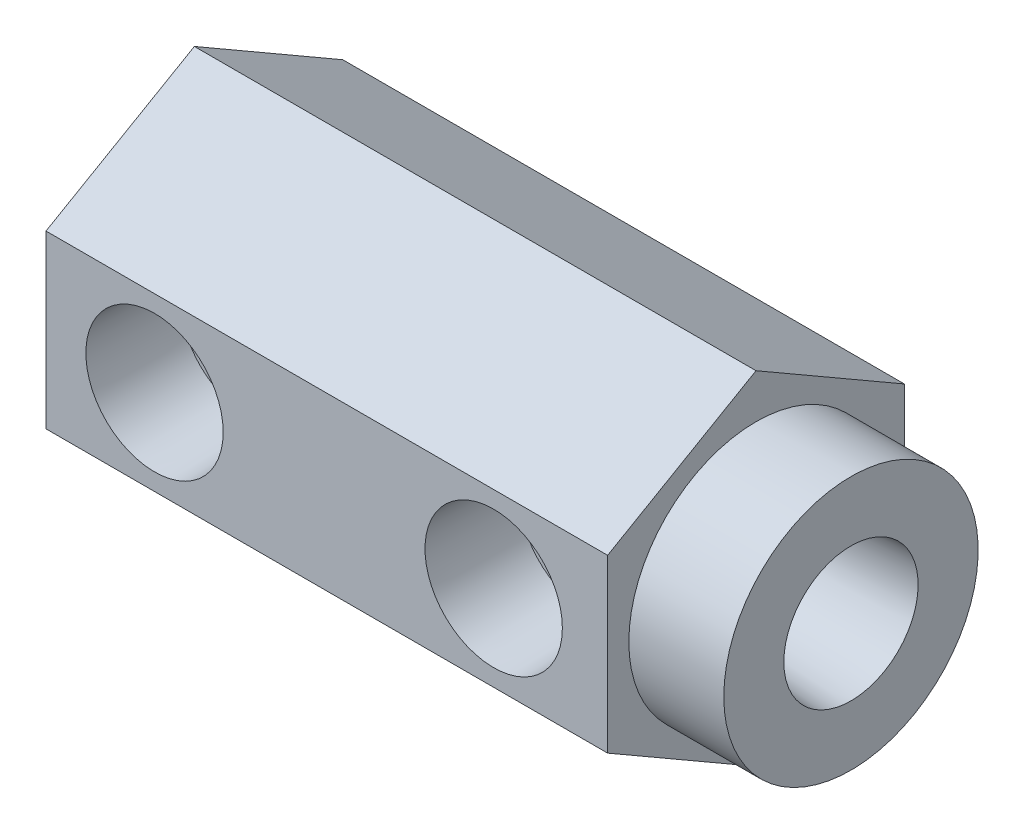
ISO-10303-21;
HEADER;
FILE_DESCRIPTION(('STEP AP214'),'2;1');
FILE_NAME('part.step','',(''),(''),'','','');
FILE_SCHEMA(('AUTOMOTIVE_DESIGN { 1 0 10303 214 1 1 1 1 }'));
ENDSEC;
DATA;
#1=APPLICATION_CONTEXT('core data for automotive mechanical design processes');
#2=APPLICATION_PROTOCOL_DEFINITION('international standard','automotive_design',2000,#1);
#3=PRODUCT_CONTEXT('',#1,'mechanical');
#4=PRODUCT('Part','Part','',(#3));
#5=PRODUCT_RELATED_PRODUCT_CATEGORY('part','',(#4));
#6=PRODUCT_DEFINITION_FORMATION('','',#4);
#7=PRODUCT_DEFINITION_CONTEXT('part definition',#1,'design');
#8=PRODUCT_DEFINITION('design','',#6,#7);
#9=PRODUCT_DEFINITION_SHAPE('','',#8);
#10=(LENGTH_UNIT() NAMED_UNIT(*) SI_UNIT(.MILLI.,.METRE.));
#11=(NAMED_UNIT(*) PLANE_ANGLE_UNIT() SI_UNIT($,.RADIAN.));
#12=(NAMED_UNIT(*) SI_UNIT($,.STERADIAN.) SOLID_ANGLE_UNIT());
#13=UNCERTAINTY_MEASURE_WITH_UNIT(LENGTH_MEASURE(1.E-05),#10,'distance_accuracy_value','');
#14=(GEOMETRIC_REPRESENTATION_CONTEXT(3) GLOBAL_UNCERTAINTY_ASSIGNED_CONTEXT((#13)) GLOBAL_UNIT_ASSIGNED_CONTEXT((#10,
#11,#12)) REPRESENTATION_CONTEXT('',''));
#15=CARTESIAN_POINT('',(0.,0.,0.));
#16=DIRECTION('',(0.,0.,1.));
#17=DIRECTION('',(1.,0.,0.));
#18=AXIS2_PLACEMENT_3D('',#15,#16,#17);
#19=CARTESIAN_POINT('',(49.1744,0.,0.));
#20=DIRECTION('',(-1.,0.,0.));
#21=DIRECTION('',(0.,0.,1.));
#22=AXIS2_PLACEMENT_3D('',#19,#20,#21);
#23=PLANE('',#22);
#24=CARTESIAN_POINT('',(49.1744,0.,0.));
#25=DIRECTION('',(-1.,0.,0.));
#26=DIRECTION('',(0.,0.,1.));
#27=AXIS2_PLACEMENT_3D('',#24,#25,#26);
#28=CIRCLE('',#27,9.525);
#29=CARTESIAN_POINT('',(49.1744,0.,9.525));
#30=VERTEX_POINT('',#29);
#31=EDGE_CURVE('E142',#30,#30,#28,.T.);
#32=ORIENTED_EDGE('',*,*,#31,.F.);
#33=EDGE_LOOP('',(#32));
#34=FACE_BOUND('',#33,.T.);
#35=CARTESIAN_POINT('',(49.1744,0.,0.));
#36=DIRECTION('',(-1.,0.,0.));
#37=DIRECTION('',(0.,0.,1.));
#38=AXIS2_PLACEMENT_3D('',#35,#36,#37);
#39=CIRCLE('',#38,5.0292);
#40=CARTESIAN_POINT('',(49.1744,0.,5.0292));
#41=VERTEX_POINT('',#40);
#42=EDGE_CURVE('E167',#41,#41,#39,.T.);
#43=ORIENTED_EDGE('',*,*,#42,.T.);
#44=EDGE_LOOP('',(#43));
#45=FACE_BOUND('',#44,.T.);
#46=ADVANCED_FACE('F35',(#34,#45),#23,.F.);
#47=CARTESIAN_POINT('',(33.528,0.,11.1125));
#48=DIRECTION('',(0.,0.,1.));
#49=DIRECTION('',(1.,0.,0.));
#50=AXIS2_PLACEMENT_3D('',#47,#48,#49);
#51=CYLINDRICAL_SURFACE('',#50,4.2164);
#52=CARTESIAN_POINT('',(37.5572446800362,1.24226256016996,4.18846));
#53=CARTESIAN_POINT('',(37.5231998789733,1.35273524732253,4.15571145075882));
#54=CARTESIAN_POINT('',(37.4849506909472,1.46061657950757,4.11894514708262));
#55=CARTESIAN_POINT('',(37.4010204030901,1.67046449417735,4.03838194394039));
#56=CARTESIAN_POINT('',(37.3553534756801,1.77244186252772,3.99459845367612));
#57=CARTESIAN_POINT('',(37.2579636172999,1.96909195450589,3.90138657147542));
#58=CARTESIAN_POINT('',(37.2063122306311,2.06383226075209,3.85202501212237));
#59=CARTESIAN_POINT('',(37.0973370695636,2.24704879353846,3.74810382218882));
#60=CARTESIAN_POINT('',(37.040010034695,2.33552136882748,3.69354120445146));
#61=CARTESIAN_POINT('',(36.9057433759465,2.52699524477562,3.56608812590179));
#62=CARTESIAN_POINT('',(36.8274426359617,2.62823562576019,3.49198535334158));
#63=CARTESIAN_POINT('',(36.6643644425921,2.82084714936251,3.33832581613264));
#64=CARTESIAN_POINT('',(36.5795859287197,2.91221667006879,3.25876815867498));
#65=CARTESIAN_POINT('',(36.4040104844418,3.08575940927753,3.09496594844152));
#66=CARTESIAN_POINT('',(36.313183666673,3.16788058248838,3.01069851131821));
#67=CARTESIAN_POINT('',(36.1266289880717,3.32262611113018,2.83900033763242));
#68=CARTESIAN_POINT('',(36.0309017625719,3.39525169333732,2.75157001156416));
#69=CARTESIAN_POINT('',(35.8327510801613,3.53285031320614,2.57262594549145));
#70=CARTESIAN_POINT('',(35.7302251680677,3.59761324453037,2.48106457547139));
#71=CARTESIAN_POINT('',(35.5205770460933,3.7178327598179,2.29700025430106));
#72=CARTESIAN_POINT('',(35.413452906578,3.77328538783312,2.2044969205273));
#73=CARTESIAN_POINT('',(35.1946305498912,3.87490518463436,2.02052791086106));
#74=CARTESIAN_POINT('',(35.0829462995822,3.9210984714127,1.92906002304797));
#75=CARTESIAN_POINT('',(34.8537235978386,4.00442086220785,1.74949909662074));
#76=CARTESIAN_POINT('',(34.7361912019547,4.04155911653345,1.66140272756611));
#77=CARTESIAN_POINT('',(34.5288880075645,4.09683754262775,1.51866750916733));
#78=CARTESIAN_POINT('',(34.4412500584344,4.11734344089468,1.46186744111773));
#79=CARTESIAN_POINT('',(34.2602263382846,4.15335926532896,1.35613372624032));
#80=CARTESIAN_POINT('',(34.166846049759,4.16887387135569,1.30719273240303));
#81=CARTESIAN_POINT('',(34.0032271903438,4.19006857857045,1.23719318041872));
#82=CARTESIAN_POINT('',(33.9349286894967,4.19730703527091,1.21220489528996));
#83=CARTESIAN_POINT('',(33.7951867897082,4.20850549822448,1.17274151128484));
#84=CARTESIAN_POINT('',(33.7237554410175,4.21247707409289,1.15822933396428));
#85=CARTESIAN_POINT('',(33.5783648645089,4.21673052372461,1.14266473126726));
#86=CARTESIAN_POINT('',(33.5043857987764,4.21696850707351,1.14177241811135));
#87=CARTESIAN_POINT('',(33.3576831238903,4.21360126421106,1.15412545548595));
#88=CARTESIAN_POINT('',(33.2849618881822,4.20998943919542,1.16739508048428));
#89=CARTESIAN_POINT('',(33.1190041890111,4.19759986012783,1.21128529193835));
#90=CARTESIAN_POINT('',(33.0270782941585,4.187494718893,1.24623585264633));
#91=CARTESIAN_POINT('',(32.8490963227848,4.16236327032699,1.32777375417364));
#92=CARTESIAN_POINT('',(32.7630740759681,4.14731106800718,1.37442201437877));
#93=CARTESIAN_POINT('',(32.5528728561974,4.10412945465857,1.49961321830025));
#94=CARTESIAN_POINT('',(32.4317509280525,4.07325238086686,1.58224397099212));
#95=CARTESIAN_POINT('',(32.1964925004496,4.00252087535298,1.75355286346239));
#96=CARTESIAN_POINT('',(32.082370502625,3.96264855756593,1.8422428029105));
#97=CARTESIAN_POINT('',(31.8591995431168,3.87396052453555,2.02210861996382));
#98=CARTESIAN_POINT('',(31.7501633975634,3.8251236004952,2.11328994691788));
#99=CARTESIAN_POINT('',(31.5367944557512,3.71851194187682,2.29570274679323));
#100=CARTESIAN_POINT('',(31.4324577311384,3.66074485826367,2.38693411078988));
#101=CARTESIAN_POINT('',(31.2217376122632,3.5320493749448,2.57385350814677));
#102=CARTESIAN_POINT('',(31.1156451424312,3.46051807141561,2.66945656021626));
#103=CARTESIAN_POINT('',(30.9087479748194,3.30668578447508,2.85780367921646));
#104=CARTESIAN_POINT('',(30.8079452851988,3.22438075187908,2.95054665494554));
#105=CARTESIAN_POINT('',(30.6125764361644,3.04885609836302,3.13157084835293));
#106=CARTESIAN_POINT('',(30.5179955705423,2.95566377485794,3.21986246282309));
#107=CARTESIAN_POINT('',(30.3358368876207,2.7579369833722,3.39076686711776));
#108=CARTESIAN_POINT('',(30.248259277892,2.65340217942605,3.47337948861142));
#109=CARTESIAN_POINT('',(30.0468993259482,2.38706899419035,3.66401417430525));
#110=CARTESIAN_POINT('',(29.9372028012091,2.21943248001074,3.76846671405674));
#111=CARTESIAN_POINT('',(29.7890253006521,1.95153796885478,3.91000109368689));
#112=CARTESIAN_POINT('',(29.742405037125,1.85961524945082,3.95461240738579));
#113=CARTESIAN_POINT('',(29.6552306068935,1.67047982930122,4.03813946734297));
#114=CARTESIAN_POINT('',(29.6146718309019,1.57327122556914,4.07705954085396));
#115=CARTESIAN_POINT('',(29.5633807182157,1.43577933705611,4.12632709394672));
#116=CARTESIAN_POINT('',(29.5497360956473,1.3975361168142,4.13943898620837));
#117=CARTESIAN_POINT('',(29.5234701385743,1.32038947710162,4.16468855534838));
#118=CARTESIAN_POINT('',(29.510848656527,1.28148615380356,4.17682637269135));
#119=CARTESIAN_POINT('',(29.4987553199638,1.24226256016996,4.18846));
#120=B_SPLINE_CURVE_WITH_KNOTS('',3,(#52,#53,#54,#55,#56,#57,#58,#59,#60,#61,#62,#63,#64,#65,
#66,#67,#68,#69,#70,#71,#72,#73,#74,#75,#76,#77,#78,#79,#80,#81,#82,#83,#84,#85,#86,#87,#88,#89,
#90,#91,#92,#93,#94,#95,#96,#97,#98,#99,#100,#101,#102,#103,#104,#105,#106,#107,#108,#109,#110,
#111,#112,#113,#114,#115,#116,#117,#118,#119),.UNSPECIFIED.,.F.,.F.,(4,2,2,2,2,2,2,2,2,2,2,2,2,
2,2,2,2,2,2,2,2,2,2,2,2,2,2,2,2,2,2,2,2,4),(0.,0.360139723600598,0.719599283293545,
1.07513522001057,1.43087659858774,1.87389656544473,2.31698921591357,2.76246242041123,
3.2078780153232,3.6633626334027,4.11904029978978,4.57341395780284,5.02732654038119,
5.34631244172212,5.66499838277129,5.88362011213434,6.10146422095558,6.32186731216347,
6.54264879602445,6.83756415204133,7.13404848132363,7.58258817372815,8.03202772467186,
8.48254461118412,8.93267763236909,9.41140117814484,9.89030516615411,10.3680331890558,
10.8457753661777,11.5205176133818,11.8571135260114,12.1934521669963,12.3214366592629,
12.4494026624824),.UNSPECIFIED.);
#121=CARTESIAN_POINT('',(37.5572446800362,1.24226256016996,4.18846));
#122=VERTEX_POINT('',#121);
#123=CARTESIAN_POINT('',(29.4987553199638,1.24226256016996,4.18846));
#124=VERTEX_POINT('',#123);
#125=EDGE_CURVE('E200',#122,#124,#120,.T.);
#126=ORIENTED_EDGE('',*,*,#125,.F.);
#127=CARTESIAN_POINT('',(33.528,0.,4.18846));
#128=DIRECTION('',(0.,0.,1.));
#129=DIRECTION('',(1.,0.,0.));
#130=AXIS2_PLACEMENT_3D('',#127,#128,#129);
#131=CIRCLE('',#130,4.2164);
#132=EDGE_CURVE('E273',#122,#124,#131,.T.);
#133=ORIENTED_EDGE('',*,*,#132,.T.);
#134=EDGE_LOOP('',(#126,#133));
#135=FACE_BOUND('',#134,.T.);
#136=ADVANCED_FACE('F211',(#135),#51,.F.);
#137=CARTESIAN_POINT('',(29.4987553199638,-1.24226256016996,4.18846));
#138=CARTESIAN_POINT('',(29.5328001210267,-1.35273524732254,4.15571145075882));
#139=CARTESIAN_POINT('',(29.5710493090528,-1.46061657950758,4.11894514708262));
#140=CARTESIAN_POINT('',(29.6549795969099,-1.67046449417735,4.03838194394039));
#141=CARTESIAN_POINT('',(29.7006465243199,-1.77244186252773,3.99459845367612));
#142=CARTESIAN_POINT('',(29.7980363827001,-1.96909195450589,3.90138657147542));
#143=CARTESIAN_POINT('',(29.8496877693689,-2.0638322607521,3.85202501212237));
#144=CARTESIAN_POINT('',(29.9586629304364,-2.24704879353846,3.74810382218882));
#145=CARTESIAN_POINT('',(30.015989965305,-2.33552136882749,3.69354120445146));
#146=CARTESIAN_POINT('',(30.1502566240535,-2.52699524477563,3.56608812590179));
#147=CARTESIAN_POINT('',(30.2285573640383,-2.6282356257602,3.49198535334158));
#148=CARTESIAN_POINT('',(30.3916355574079,-2.82084714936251,3.33832581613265));
#149=CARTESIAN_POINT('',(30.4764140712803,-2.9122166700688,3.25876815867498));
#150=CARTESIAN_POINT('',(30.6519895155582,-3.08575940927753,3.09496594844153));
#151=CARTESIAN_POINT('',(30.742816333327,-3.16788058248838,3.01069851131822));
#152=CARTESIAN_POINT('',(30.9293710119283,-3.32262611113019,2.83900033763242));
#153=CARTESIAN_POINT('',(31.0250982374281,-3.39525169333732,2.75157001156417));
#154=CARTESIAN_POINT('',(31.2232489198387,-3.53285031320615,2.57262594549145));
#155=CARTESIAN_POINT('',(31.3257748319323,-3.59761324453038,2.48106457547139));
#156=CARTESIAN_POINT('',(31.5354229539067,-3.7178327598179,2.29700025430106));
#157=CARTESIAN_POINT('',(31.642547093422,-3.77328538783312,2.2044969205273));
#158=CARTESIAN_POINT('',(31.8613694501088,-3.87490518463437,2.02052791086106));
#159=CARTESIAN_POINT('',(31.9730537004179,-3.9210984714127,1.92906002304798));
#160=CARTESIAN_POINT('',(32.2022764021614,-4.00442086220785,1.74949909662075));
#161=CARTESIAN_POINT('',(32.3198087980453,-4.04155911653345,1.66140272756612));
#162=CARTESIAN_POINT('',(32.5271119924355,-4.09683754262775,1.51866750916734));
#163=CARTESIAN_POINT('',(32.6147499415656,-4.11734344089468,1.46186744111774));
#164=CARTESIAN_POINT('',(32.7957736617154,-4.15335926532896,1.35613372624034));
#165=CARTESIAN_POINT('',(32.889153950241,-4.16887387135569,1.30719273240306));
#166=CARTESIAN_POINT('',(33.0527728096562,-4.19006857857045,1.23719318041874));
#167=CARTESIAN_POINT('',(33.1210713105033,-4.19730703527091,1.21220489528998));
#168=CARTESIAN_POINT('',(33.2608132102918,-4.20850549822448,1.17274151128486));
#169=CARTESIAN_POINT('',(33.3322445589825,-4.21247707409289,1.15822933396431));
#170=CARTESIAN_POINT('',(33.4776351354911,-4.21673052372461,1.14266473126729));
#171=CARTESIAN_POINT('',(33.5516142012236,-4.21696850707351,1.14177241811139));
#172=CARTESIAN_POINT('',(33.6983168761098,-4.21360126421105,1.15412545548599));
#173=CARTESIAN_POINT('',(33.7710381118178,-4.20998943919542,1.16739508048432));
#174=CARTESIAN_POINT('',(33.9369958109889,-4.19759986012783,1.21128529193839));
#175=CARTESIAN_POINT('',(34.0289217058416,-4.187494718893,1.24623585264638));
#176=CARTESIAN_POINT('',(34.2069036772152,-4.16236327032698,1.3277737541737));
#177=CARTESIAN_POINT('',(34.292925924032,-4.14731106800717,1.37442201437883));
#178=CARTESIAN_POINT('',(34.5031271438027,-4.10412945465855,1.49961321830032));
#179=CARTESIAN_POINT('',(34.6242490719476,-4.07325238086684,1.5822439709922));
#180=CARTESIAN_POINT('',(34.8595074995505,-4.00252087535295,1.75355286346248));
#181=CARTESIAN_POINT('',(34.9736294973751,-3.9626485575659,1.8422428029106));
#182=CARTESIAN_POINT('',(35.1968004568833,-3.8739605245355,2.02210861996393));
#183=CARTESIAN_POINT('',(35.3058366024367,-3.82512360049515,2.11328994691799));
#184=CARTESIAN_POINT('',(35.5192055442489,-3.71851194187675,2.29570274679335));
#185=CARTESIAN_POINT('',(35.6235422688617,-3.6607448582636,2.38693411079));
#186=CARTESIAN_POINT('',(35.8342623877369,-3.53204937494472,2.5738535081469));
#187=CARTESIAN_POINT('',(35.940354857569,-3.46051807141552,2.66945656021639));
#188=CARTESIAN_POINT('',(36.1472520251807,-3.30668578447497,2.85780367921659));
#189=CARTESIAN_POINT('',(36.2480547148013,-3.22438075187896,2.95054665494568));
#190=CARTESIAN_POINT('',(36.4434235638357,-3.04885609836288,3.13157084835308));
#191=CARTESIAN_POINT('',(36.5380044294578,-2.95566377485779,3.21986246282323));
#192=CARTESIAN_POINT('',(36.7201631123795,-2.75793698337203,3.3907668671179));
#193=CARTESIAN_POINT('',(36.8077407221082,-2.65340217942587,3.47337948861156));
#194=CARTESIAN_POINT('',(37.0091006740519,-2.38706899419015,3.66401417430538));
#195=CARTESIAN_POINT('',(37.118797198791,-2.21943248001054,3.76846671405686));
#196=CARTESIAN_POINT('',(37.2669746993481,-1.95153796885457,3.910001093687));
#197=CARTESIAN_POINT('',(37.3135949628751,-1.85961524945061,3.95461240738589));
#198=CARTESIAN_POINT('',(37.4007693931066,-1.67047982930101,4.03813946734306));
#199=CARTESIAN_POINT('',(37.4413281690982,-1.57327122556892,4.07705954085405));
#200=CARTESIAN_POINT('',(37.4926192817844,-1.43577933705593,4.12632709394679));
#201=CARTESIAN_POINT('',(37.5062639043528,-1.39753611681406,4.13943898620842));
#202=CARTESIAN_POINT('',(37.5325298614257,-1.32038947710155,4.1646885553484));
#203=CARTESIAN_POINT('',(37.545151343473,-1.28148615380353,4.17682637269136));
#204=CARTESIAN_POINT('',(37.5572446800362,-1.24226256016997,4.18846));
#205=B_SPLINE_CURVE_WITH_KNOTS('',3,(#137,#138,#139,#140,#141,#142,#143,#144,#145,#146,#147,
#148,#149,#150,#151,#152,#153,#154,#155,#156,#157,#158,#159,#160,#161,#162,#163,#164,#165,#166,
#167,#168,#169,#170,#171,#172,#173,#174,#175,#176,#177,#178,#179,#180,#181,#182,#183,#184,#185,
#186,#187,#188,#189,#190,#191,#192,#193,#194,#195,#196,#197,#198,#199,#200,#201,#202,#203,#204),
.UNSPECIFIED.,.F.,.F.,(4,2,2,2,2,2,2,2,2,2,2,2,2,2,2,2,2,2,2,2,2,2,2,2,2,2,2,2,2,2,2,2,2,4),(0.,
0.360139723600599,0.719599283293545,1.07513522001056,1.43087659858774,1.87389656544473,
2.31698921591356,2.76246242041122,3.2078780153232,3.6633626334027,4.11904029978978,
4.57341395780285,5.02732654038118,5.34631244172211,5.66499838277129,5.88362011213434,
6.10146422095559,6.32186731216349,6.54264879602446,6.83756415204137,7.13404848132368,
7.58258817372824,8.03202772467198,8.48254461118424,8.93267763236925,9.41140117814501,
9.89030516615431,10.3680331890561,10.8457753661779,11.520517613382,11.8571135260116,
12.1934521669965,12.321436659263,12.4494026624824),.UNSPECIFIED.);
#206=CARTESIAN_POINT('',(29.4987553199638,-1.24226256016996,4.18846));
#207=VERTEX_POINT('',#206);
#208=CARTESIAN_POINT('',(37.5572446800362,-1.24226256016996,4.18846));
#209=VERTEX_POINT('',#208);
#210=EDGE_CURVE('E192',#207,#209,#205,.T.);
#211=ORIENTED_EDGE('',*,*,#210,.F.);
#212=EDGE_CURVE('E276',#207,#209,#131,.T.);
#213=ORIENTED_EDGE('',*,*,#212,.T.);
#214=EDGE_LOOP('',(#211,#213));
#215=FACE_BOUND('',#214,.T.);
#216=ADVANCED_FACE('F215',(#215),#51,.F.);
#217=CARTESIAN_POINT('',(37.7444,0.,4.18846));
#218=DIRECTION('',(0.,0.,-1.));
#219=DIRECTION('',(-1.,0.,0.));
#220=AXIS2_PLACEMENT_3D('',#217,#218,#219);
#221=PLANE('',#220);
#222=DIRECTION('',(-1.,0.,0.));
#223=VECTOR('',#222,1.);
#224=CARTESIAN_POINT('',(0.,-1.24226256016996,4.18846));
#225=LINE('',#224,#223);
#226=CARTESIAN_POINT('',(28.7506884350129,-1.24226256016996,4.18846));
#227=VERTEX_POINT('',#226);
#228=EDGE_CURVE('E363',#227,#207,#225,.F.);
#229=ORIENTED_EDGE('',*,*,#228,.F.);
#230=CARTESIAN_POINT('',(33.528,0.,4.18846));
#231=DIRECTION('',(0.,0.,1.));
#232=DIRECTION('',(1.,0.,0.));
#233=AXIS2_PLACEMENT_3D('',#230,#231,#232);
#234=CIRCLE('',#233,4.93618496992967);
#235=CARTESIAN_POINT('',(38.3053115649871,-1.24226256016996,4.18846));
#236=VERTEX_POINT('',#235);
#237=EDGE_CURVE('E280',#227,#236,#234,.T.);
#238=ORIENTED_EDGE('',*,*,#237,.T.);
#239=EDGE_CURVE('E360',#209,#236,#225,.F.);
#240=ORIENTED_EDGE('',*,*,#239,.F.);
#241=ORIENTED_EDGE('',*,*,#212,.F.);
#242=EDGE_LOOP('',(#229,#238,#240,#241));
#243=FACE_BOUND('',#242,.T.);
#244=ADVANCED_FACE('F218',(#243),#221,.F.);
#245=DIRECTION('',(-1.,0.,0.));
#246=VECTOR('',#245,1.);
#247=CARTESIAN_POINT('',(0.,1.24226256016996,4.18846));
#248=LINE('',#247,#246);
#249=CARTESIAN_POINT('',(38.3053115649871,1.24226256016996,4.18846));
#250=VERTEX_POINT('',#249);
#251=EDGE_CURVE('E205',#250,#122,#248,.T.);
#252=ORIENTED_EDGE('',*,*,#251,.F.);
#253=CARTESIAN_POINT('',(28.7506884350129,1.24226256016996,4.18846));
#254=VERTEX_POINT('',#253);
#255=EDGE_CURVE('E277',#250,#254,#234,.T.);
#256=ORIENTED_EDGE('',*,*,#255,.T.);
#257=EDGE_CURVE('E56',#124,#254,#248,.T.);
#258=ORIENTED_EDGE('',*,*,#257,.F.);
#259=ORIENTED_EDGE('',*,*,#132,.F.);
#260=EDGE_LOOP('',(#252,#256,#258,#259));
#261=FACE_BOUND('',#260,.T.);
#262=ADVANCED_FACE('F344',(#261),#221,.F.);
#263=CARTESIAN_POINT('',(33.528,0.,11.1125));
#264=DIRECTION('',(0.,0.,1.));
#265=DIRECTION('',(1.,0.,0.));
#266=AXIS2_PLACEMENT_3D('',#263,#264,#265);
#267=CONICAL_SURFACE('',#266,5.1435,0.0299323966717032);
#268=CARTESIAN_POINT('',(33.528,0.,11.1125));
#269=DIRECTION('',(0.,0.,1.));
#270=DIRECTION('',(1.,0.,0.));
#271=AXIS2_PLACEMENT_3D('',#268,#269,#270);
#272=CIRCLE('',#271,5.1435);
#273=CARTESIAN_POINT('',(38.6715,0.,11.1125));
#274=VERTEX_POINT('',#273);
#275=EDGE_CURVE('E281',#274,#274,#272,.T.);
#276=ORIENTED_EDGE('',*,*,#275,.T.);
#277=EDGE_LOOP('',(#276));
#278=FACE_BOUND('',#277,.T.);
#279=CARTESIAN_POINT('',(38.3051300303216,-1.24293668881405,4.18826));
#280=CARTESIAN_POINT('',(38.3286071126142,-1.15583523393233,4.21412336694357));
#281=CARTESIAN_POINT('',(38.3497868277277,-1.06732839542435,4.23741836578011));
#282=CARTESIAN_POINT('',(38.3872560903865,-0.888007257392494,4.27858516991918));
#283=CARTESIAN_POINT('',(38.4035434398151,-0.797191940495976,4.29645453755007));
#284=CARTESIAN_POINT('',(38.4309049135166,-0.613876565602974,4.32645329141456));
#285=CARTESIAN_POINT('',(38.4419813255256,-0.521377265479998,4.33858519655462));
#286=CARTESIAN_POINT('',(38.4587218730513,-0.335324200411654,4.35691457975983));
#287=CARTESIAN_POINT('',(38.4643871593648,-0.241770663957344,4.36311331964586));
#288=CARTESIAN_POINT('',(38.4702050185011,-0.0540097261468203,4.36947895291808));
#289=CARTESIAN_POINT('',(38.470341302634,0.0401987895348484,4.36962802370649));
#290=CARTESIAN_POINT('',(38.4650571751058,0.22827319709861,4.36384645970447));
#291=CARTESIAN_POINT('',(38.459636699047,0.322139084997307,4.35791575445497));
#292=CARTESIAN_POINT('',(38.4433617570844,0.508659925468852,4.34009705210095));
#293=CARTESIAN_POINT('',(38.4325165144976,0.601316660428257,4.32821916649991));
#294=CARTESIAN_POINT('',(38.4056075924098,0.784900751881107,4.29871858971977));
#295=CARTESIAN_POINT('',(38.3895464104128,0.875828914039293,4.28109864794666));
#296=CARTESIAN_POINT('',(38.3613463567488,1.01252796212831,4.25011977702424));
#297=CARTESIAN_POINT('',(38.3509951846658,1.05913454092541,4.23874207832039));
#298=CARTESIAN_POINT('',(38.3290123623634,1.15159574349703,4.21456055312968));
#299=CARTESIAN_POINT('',(38.3173825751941,1.19745135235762,4.20175880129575));
#300=CARTESIAN_POINT('',(38.3051300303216,1.24293668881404,4.18826));
#301=B_SPLINE_CURVE_WITH_KNOTS('',3,(#279,#280,#281,#282,#283,#284,#285,#286,#287,#288,#289,
#290,#291,#292,#293,#294,#295,#296,#297,#298,#299,#300),.UNSPECIFIED.,.F.,.F.,(4,2,2,2,2,2,2,2,
2,2,4),(0.,0.281492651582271,0.563111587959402,0.844606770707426,1.12604207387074,
1.40830643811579,1.69057407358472,1.97236341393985,2.25401802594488,2.40121826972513,
2.54820680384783),.UNSPECIFIED.);
#302=EDGE_CURVE('E11',#236,#250,#301,.T.);
#303=ORIENTED_EDGE('',*,*,#302,.F.);
#304=ORIENTED_EDGE('',*,*,#237,.F.);
#305=CARTESIAN_POINT('',(28.7508699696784,1.24293668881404,4.18826));
#306=CARTESIAN_POINT('',(28.7273928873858,1.15583523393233,4.21412336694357));
#307=CARTESIAN_POINT('',(28.7062131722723,1.06732839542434,4.23741836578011));
#308=CARTESIAN_POINT('',(28.6687439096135,0.888007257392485,4.27858516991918));
#309=CARTESIAN_POINT('',(28.6524565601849,0.797191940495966,4.29645453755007));
#310=CARTESIAN_POINT('',(28.6250950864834,0.613876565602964,4.32645329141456));
#311=CARTESIAN_POINT('',(28.6140186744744,0.521377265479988,4.33858519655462));
#312=CARTESIAN_POINT('',(28.5972781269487,0.335324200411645,4.35691457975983));
#313=CARTESIAN_POINT('',(28.5916128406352,0.241770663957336,4.36311331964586));
#314=CARTESIAN_POINT('',(28.5857949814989,0.0540097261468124,4.36947895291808));
#315=CARTESIAN_POINT('',(28.585658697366,-0.0401987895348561,4.36962802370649));
#316=CARTESIAN_POINT('',(28.5909428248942,-0.228273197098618,4.36384645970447));
#317=CARTESIAN_POINT('',(28.596363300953,-0.322139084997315,4.35791575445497));
#318=CARTESIAN_POINT('',(28.6126382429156,-0.50865992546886,4.34009705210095));
#319=CARTESIAN_POINT('',(28.6234834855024,-0.601316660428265,4.32821916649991));
#320=CARTESIAN_POINT('',(28.6503924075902,-0.784900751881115,4.29871858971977));
#321=CARTESIAN_POINT('',(28.6664535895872,-0.875828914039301,4.28109864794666));
#322=CARTESIAN_POINT('',(28.6946536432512,-1.01252796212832,4.25011977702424));
#323=CARTESIAN_POINT('',(28.7050048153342,-1.05913454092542,4.23874207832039));
#324=CARTESIAN_POINT('',(28.7269876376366,-1.15159574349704,4.21456055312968));
#325=CARTESIAN_POINT('',(28.738617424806,-1.19745135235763,4.20175880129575));
#326=CARTESIAN_POINT('',(28.7508699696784,-1.24293668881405,4.18826));
#327=B_SPLINE_CURVE_WITH_KNOTS('',3,(#305,#306,#307,#308,#309,#310,#311,#312,#313,#314,#315,
#316,#317,#318,#319,#320,#321,#322,#323,#324,#325,#326),.UNSPECIFIED.,.F.,.F.,(4,2,2,2,2,2,2,2,
2,2,4),(0.,0.281492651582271,0.563111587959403,0.844606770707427,1.12604207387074,
1.40830643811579,1.69057407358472,1.97236341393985,2.25401802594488,2.40121826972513,
2.54820680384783),.UNSPECIFIED.);
#328=EDGE_CURVE('E49',#254,#227,#327,.T.);
#329=ORIENTED_EDGE('',*,*,#328,.F.);
#330=ORIENTED_EDGE('',*,*,#255,.F.);
#331=EDGE_LOOP('',(#303,#304,#329,#330));
#332=FACE_BOUND('',#331,.T.);
#333=ADVANCED_FACE('F172',(#278,#332),#267,.F.);
#334=CARTESIAN_POINT('',(49.1744,0.,0.));
#335=DIRECTION('',(1.,0.,0.));
#336=DIRECTION('',(0.,0.,-1.));
#337=AXIS2_PLACEMENT_3D('',#334,#335,#336);
#338=CYLINDRICAL_SURFACE('',#337,2.38124999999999);
#339=CARTESIAN_POINT('',(19.2024,0.,0.));
#340=DIRECTION('',(1.,0.,0.));
#341=DIRECTION('',(0.,0.,-1.));
#342=AXIS2_PLACEMENT_3D('',#339,#340,#341);
#343=CIRCLE('',#342,2.38124999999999);
#344=CARTESIAN_POINT('',(19.2024,0.,-2.38124999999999));
#345=VERTEX_POINT('',#344);
#346=EDGE_CURVE('E164',#345,#345,#343,.T.);
#347=ORIENTED_EDGE('',*,*,#346,.F.);
#348=EDGE_LOOP('',(#347));
#349=FACE_BOUND('',#348,.T.);
#350=CARTESIAN_POINT('',(26.9494,0.,0.));
#351=DIRECTION('',(1.,0.,0.));
#352=DIRECTION('',(0.,0.,-1.));
#353=AXIS2_PLACEMENT_3D('',#350,#351,#352);
#354=CIRCLE('',#353,2.38124999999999);
#355=CARTESIAN_POINT('',(26.9494,0.,-2.38124999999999));
#356=VERTEX_POINT('',#355);
#357=EDGE_CURVE('E165',#356,#356,#354,.F.);
#358=ORIENTED_EDGE('',*,*,#357,.F.);
#359=EDGE_LOOP('',(#358));
#360=FACE_BOUND('',#359,.T.);
#361=ADVANCED_FACE('F256',(#349,#360),#338,.F.);
#362=CARTESIAN_POINT('',(42.0624,6.41580486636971,11.1125));
#363=DIRECTION('',(0.,0.,-1.));
#364=DIRECTION('',(0.,1.,0.));
#365=AXIS2_PLACEMENT_3D('',#362,#363,#364);
#366=PLANE('',#365);
#367=CARTESIAN_POINT('',(8.128,0.,11.1125));
#368=DIRECTION('',(0.,0.,1.));
#369=DIRECTION('',(1.,0.,0.));
#370=AXIS2_PLACEMENT_3D('',#367,#368,#369);
#371=CIRCLE('',#370,5.1435);
#372=CARTESIAN_POINT('',(13.2715,0.,11.1125));
#373=VERTEX_POINT('',#372);
#374=EDGE_CURVE('E290',#373,#373,#371,.T.);
#375=ORIENTED_EDGE('',*,*,#374,.F.);
#376=EDGE_LOOP('',(#375));
#377=FACE_BOUND('',#376,.T.);
#378=ORIENTED_EDGE('',*,*,#275,.F.);
#379=EDGE_LOOP('',(#378));
#380=FACE_BOUND('',#379,.T.);
#381=DIRECTION('',(0.,-1.,0.));
#382=VECTOR('',#381,1.);
#383=CARTESIAN_POINT('',(0.,6.41580486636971,11.1125));
#384=LINE('',#383,#382);
#385=CARTESIAN_POINT('',(0.,6.41580486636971,11.1125));
#386=VERTEX_POINT('',#385);
#387=CARTESIAN_POINT('',(0.,-6.41580486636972,11.1125));
#388=VERTEX_POINT('',#387);
#389=EDGE_CURVE('E138',#386,#388,#384,.T.);
#390=ORIENTED_EDGE('',*,*,#389,.T.);
#391=DIRECTION('',(-1.,0.,0.));
#392=VECTOR('',#391,1.);
#393=CARTESIAN_POINT('',(42.0624,-6.41580486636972,11.1125));
#394=LINE('',#393,#392);
#395=CARTESIAN_POINT('',(42.0624,-6.41580486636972,11.1125));
#396=VERTEX_POINT('',#395);
#397=EDGE_CURVE('E157',#396,#388,#394,.T.);
#398=ORIENTED_EDGE('',*,*,#397,.F.);
#399=DIRECTION('',(0.,-1.,0.));
#400=VECTOR('',#399,1.);
#401=CARTESIAN_POINT('',(42.0624,6.41580486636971,11.1125));
#402=LINE('',#401,#400);
#403=CARTESIAN_POINT('',(42.0624,6.41580486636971,11.1125));
#404=VERTEX_POINT('',#403);
#405=EDGE_CURVE('E150',#404,#396,#402,.T.);
#406=ORIENTED_EDGE('',*,*,#405,.F.);
#407=DIRECTION('',(-1.,0.,0.));
#408=VECTOR('',#407,1.);
#409=CARTESIAN_POINT('',(42.0624,6.41580486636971,11.1125));
#410=LINE('',#409,#408);
#411=EDGE_CURVE('E134',#404,#386,#410,.T.);
#412=ORIENTED_EDGE('',*,*,#411,.T.);
#413=EDGE_LOOP('',(#390,#398,#406,#412));
#414=FACE_BOUND('',#413,.T.);
#415=ADVANCED_FACE('F37',(#377,#380,#414),#366,.F.);
#416=CARTESIAN_POINT('',(42.0624,-6.41580486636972,11.1125));
#417=DIRECTION('',(0.,0.866025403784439,-0.5));
#418=DIRECTION('',(0.,0.5,0.866025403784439));
#419=AXIS2_PLACEMENT_3D('',#416,#417,#418);
#420=PLANE('',#419);
#421=DIRECTION('',(0.,-0.5,-0.866025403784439));
#422=VECTOR('',#421,1.);
#423=CARTESIAN_POINT('',(0.,-6.41580486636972,11.1125));
#424=LINE('',#423,#422);
#425=CARTESIAN_POINT('',(0.,-12.8316097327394,0.));
#426=VERTEX_POINT('',#425);
#427=EDGE_CURVE('E141',#388,#426,#424,.T.);
#428=ORIENTED_EDGE('',*,*,#427,.T.);
#429=DIRECTION('',(-1.,0.,0.));
#430=VECTOR('',#429,1.);
#431=CARTESIAN_POINT('',(42.0624,-12.8316097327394,0.));
#432=LINE('',#431,#430);
#433=CARTESIAN_POINT('',(42.0624,-12.8316097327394,0.));
#434=VERTEX_POINT('',#433);
#435=EDGE_CURVE('E154',#434,#426,#432,.T.);
#436=ORIENTED_EDGE('',*,*,#435,.F.);
#437=DIRECTION('',(0.,-0.5,-0.866025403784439));
#438=VECTOR('',#437,1.);
#439=CARTESIAN_POINT('',(42.0624,-6.41580486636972,11.1125));
#440=LINE('',#439,#438);
#441=EDGE_CURVE('E101',#396,#434,#440,.T.);
#442=ORIENTED_EDGE('',*,*,#441,.F.);
#443=ORIENTED_EDGE('',*,*,#397,.T.);
#444=EDGE_LOOP('',(#428,#436,#442,#443));
#445=FACE_BOUND('',#444,.T.);
#446=ADVANCED_FACE('F250',(#445),#420,.F.);
#447=CARTESIAN_POINT('',(42.0624,-12.8316097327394,0.));
#448=DIRECTION('',(0.,0.866025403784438,0.5));
#449=DIRECTION('',(0.,-0.5,0.866025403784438));
#450=AXIS2_PLACEMENT_3D('',#447,#448,#449);
#451=PLANE('',#450);
#452=DIRECTION('',(0.,0.5,-0.866025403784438));
#453=VECTOR('',#452,1.);
#454=CARTESIAN_POINT('',(0.,-12.8316097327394,0.));
#455=LINE('',#454,#453);
#456=CARTESIAN_POINT('',(0.,-6.41580486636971,-11.1125));
#457=VERTEX_POINT('',#456);
#458=EDGE_CURVE('E144',#426,#457,#455,.T.);
#459=ORIENTED_EDGE('',*,*,#458,.T.);
#460=DIRECTION('',(-1.,0.,0.));
#461=VECTOR('',#460,1.);
#462=CARTESIAN_POINT('',(42.0624,-6.41580486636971,-11.1125));
#463=LINE('',#462,#461);
#464=CARTESIAN_POINT('',(42.0624,-6.41580486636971,-11.1125));
#465=VERTEX_POINT('',#464);
#466=EDGE_CURVE('E129',#465,#457,#463,.T.);
#467=ORIENTED_EDGE('',*,*,#466,.F.);
#468=DIRECTION('',(0.,0.5,-0.866025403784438));
#469=VECTOR('',#468,1.);
#470=CARTESIAN_POINT('',(42.0624,-12.8316097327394,0.));
#471=LINE('',#470,#469);
#472=EDGE_CURVE('E117',#434,#465,#471,.T.);
#473=ORIENTED_EDGE('',*,*,#472,.F.);
#474=ORIENTED_EDGE('',*,*,#435,.T.);
#475=EDGE_LOOP('',(#459,#467,#473,#474));
#476=FACE_BOUND('',#475,.T.);
#477=ADVANCED_FACE('F247',(#476),#451,.F.);
#478=CARTESIAN_POINT('',(42.0624,-6.41580486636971,-11.1125));
#479=DIRECTION('',(0.,0.,1.));
#480=DIRECTION('',(1.,0.,0.));
#481=AXIS2_PLACEMENT_3D('',#478,#479,#480);
#482=PLANE('',#481);
#483=CARTESIAN_POINT('',(8.128,0.,-11.1125));
#484=DIRECTION('',(0.,0.,-1.));
#485=DIRECTION('',(-1.,0.,0.));
#486=AXIS2_PLACEMENT_3D('',#483,#484,#485);
#487=CIRCLE('',#486,5.1435);
#488=CARTESIAN_POINT('',(2.9845,0.,-11.1125));
#489=VERTEX_POINT('',#488);
#490=EDGE_CURVE('E299',#489,#489,#487,.T.);
#491=ORIENTED_EDGE('',*,*,#490,.F.);
#492=EDGE_LOOP('',(#491));
#493=FACE_BOUND('',#492,.T.);
#494=DIRECTION('',(0.,1.,0.));
#495=VECTOR('',#494,1.);
#496=CARTESIAN_POINT('',(0.,-6.41580486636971,-11.1125));
#497=LINE('',#496,#495);
#498=CARTESIAN_POINT('',(0.,6.41580486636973,-11.1125));
#499=VERTEX_POINT('',#498);
#500=EDGE_CURVE('E126',#457,#499,#497,.T.);
#501=ORIENTED_EDGE('',*,*,#500,.T.);
#502=DIRECTION('',(-1.,0.,0.));
#503=VECTOR('',#502,1.);
#504=CARTESIAN_POINT('',(42.0624,6.41580486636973,-11.1125));
#505=LINE('',#504,#503);
#506=CARTESIAN_POINT('',(42.0624,6.41580486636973,-11.1125));
#507=VERTEX_POINT('',#506);
#508=EDGE_CURVE('E123',#507,#499,#505,.T.);
#509=ORIENTED_EDGE('',*,*,#508,.F.);
#510=DIRECTION('',(0.,1.,0.));
#511=VECTOR('',#510,1.);
#512=CARTESIAN_POINT('',(42.0624,-6.41580486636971,-11.1125));
#513=LINE('',#512,#511);
#514=EDGE_CURVE('E110',#465,#507,#513,.T.);
#515=ORIENTED_EDGE('',*,*,#514,.F.);
#516=ORIENTED_EDGE('',*,*,#466,.T.);
#517=EDGE_LOOP('',(#501,#509,#515,#516));
#518=FACE_BOUND('',#517,.T.);
#519=ADVANCED_FACE('F124',(#493,#518),#482,.F.);
#520=CARTESIAN_POINT('',(42.0624,6.41580486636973,-11.1125));
#521=DIRECTION('',(0.,-0.866025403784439,0.5));
#522=DIRECTION('',(0.,-0.5,-0.866025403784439));
#523=AXIS2_PLACEMENT_3D('',#520,#521,#522);
#524=PLANE('',#523);
#525=DIRECTION('',(0.,0.5,0.866025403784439));
#526=VECTOR('',#525,1.);
#527=CARTESIAN_POINT('',(0.,6.41580486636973,-11.1125));
#528=LINE('',#527,#526);
#529=CARTESIAN_POINT('',(0.,12.8316097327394,0.));
#530=VERTEX_POINT('',#529);
#531=EDGE_CURVE('E147',#499,#530,#528,.T.);
#532=ORIENTED_EDGE('',*,*,#531,.T.);
#533=DIRECTION('',(-1.,0.,0.));
#534=VECTOR('',#533,1.);
#535=CARTESIAN_POINT('',(42.0624,12.8316097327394,0.));
#536=LINE('',#535,#534);
#537=CARTESIAN_POINT('',(42.0624,12.8316097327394,0.));
#538=VERTEX_POINT('',#537);
#539=EDGE_CURVE('E130',#538,#530,#536,.T.);
#540=ORIENTED_EDGE('',*,*,#539,.F.);
#541=DIRECTION('',(0.,0.5,0.866025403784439));
#542=VECTOR('',#541,1.);
#543=CARTESIAN_POINT('',(42.0624,6.41580486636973,-11.1125));
#544=LINE('',#543,#542);
#545=EDGE_CURVE('E114',#507,#538,#544,.T.);
#546=ORIENTED_EDGE('',*,*,#545,.F.);
#547=ORIENTED_EDGE('',*,*,#508,.T.);
#548=EDGE_LOOP('',(#532,#540,#546,#547));
#549=FACE_BOUND('',#548,.T.);
#550=ADVANCED_FACE('F132',(#549),#524,.F.);
#551=CARTESIAN_POINT('',(42.0624,12.8316097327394,0.));
#552=DIRECTION('',(0.,-0.866025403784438,-0.500000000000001));
#553=DIRECTION('',(0.,0.500000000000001,-0.866025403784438));
#554=AXIS2_PLACEMENT_3D('',#551,#552,#553);
#555=PLANE('',#554);
#556=DIRECTION('',(0.,-0.500000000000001,0.866025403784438));
#557=VECTOR('',#556,1.);
#558=CARTESIAN_POINT('',(0.,12.8316097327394,0.));
#559=LINE('',#558,#557);
#560=EDGE_CURVE('E92',#530,#386,#559,.T.);
#561=ORIENTED_EDGE('',*,*,#560,.T.);
#562=ORIENTED_EDGE('',*,*,#411,.F.);
#563=DIRECTION('',(0.,-0.500000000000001,0.866025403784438));
#564=VECTOR('',#563,1.);
#565=CARTESIAN_POINT('',(42.0624,12.8316097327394,0.));
#566=LINE('',#565,#564);
#567=EDGE_CURVE('E65',#538,#404,#566,.T.);
#568=ORIENTED_EDGE('',*,*,#567,.F.);
#569=ORIENTED_EDGE('',*,*,#539,.T.);
#570=EDGE_LOOP('',(#561,#562,#568,#569));
#571=FACE_BOUND('',#570,.T.);
#572=ADVANCED_FACE('F236',(#571),#555,.F.);
#573=CARTESIAN_POINT('',(42.0624,-6.41580486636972,11.1125));
#574=DIRECTION('',(1.,0.,0.));
#575=DIRECTION('',(0.,0.,-1.));
#576=AXIS2_PLACEMENT_3D('',#573,#574,#575);
#577=PLANE('',#576);
#578=CARTESIAN_POINT('',(42.0624,0.,0.));
#579=DIRECTION('',(1.,0.,0.));
#580=DIRECTION('',(0.,0.,-1.));
#581=AXIS2_PLACEMENT_3D('',#578,#579,#580);
#582=CIRCLE('',#581,9.525);
#583=CARTESIAN_POINT('',(42.0624,0.,-9.525));
#584=VERTEX_POINT('',#583);
#585=EDGE_CURVE('E159',#584,#584,#582,.T.);
#586=ORIENTED_EDGE('',*,*,#585,.F.);
#587=EDGE_LOOP('',(#586));
#588=FACE_BOUND('',#587,.T.);
#589=ORIENTED_EDGE('',*,*,#405,.T.);
#590=ORIENTED_EDGE('',*,*,#441,.T.);
#591=ORIENTED_EDGE('',*,*,#472,.T.);
#592=ORIENTED_EDGE('',*,*,#514,.T.);
#593=ORIENTED_EDGE('',*,*,#545,.T.);
#594=ORIENTED_EDGE('',*,*,#567,.T.);
#595=EDGE_LOOP('',(#589,#590,#591,#592,#593,#594));
#596=FACE_BOUND('',#595,.T.);
#597=ADVANCED_FACE('F112',(#588,#596),#577,.T.);
#598=CARTESIAN_POINT('',(0.,-6.41580486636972,11.1125));
#599=DIRECTION('',(1.,0.,0.));
#600=DIRECTION('',(0.,0.,-1.));
#601=AXIS2_PLACEMENT_3D('',#598,#599,#600);
#602=PLANE('',#601);
#603=ORIENTED_EDGE('',*,*,#389,.F.);
#604=ORIENTED_EDGE('',*,*,#560,.F.);
#605=ORIENTED_EDGE('',*,*,#531,.F.);
#606=ORIENTED_EDGE('',*,*,#500,.F.);
#607=ORIENTED_EDGE('',*,*,#458,.F.);
#608=ORIENTED_EDGE('',*,*,#427,.F.);
#609=EDGE_LOOP('',(#603,#604,#605,#606,#607,#608));
#610=FACE_BOUND('',#609,.T.);
#611=ADVANCED_FACE('F232',(#610),#602,.F.);
#612=CARTESIAN_POINT('',(49.1744,0.,0.));
#613=DIRECTION('',(-1.,0.,0.));
#614=DIRECTION('',(0.,0.,1.));
#615=AXIS2_PLACEMENT_3D('',#612,#613,#614);
#616=CYLINDRICAL_SURFACE('',#615,9.525);
#617=ORIENTED_EDGE('',*,*,#585,.T.);
#618=EDGE_LOOP('',(#617));
#619=FACE_BOUND('',#618,.T.);
#620=ORIENTED_EDGE('',*,*,#31,.T.);
#621=EDGE_LOOP('',(#620));
#622=FACE_BOUND('',#621,.T.);
#623=ADVANCED_FACE('F228',(#619,#622),#616,.T.);
#624=CARTESIAN_POINT('',(8.128,0.,11.1125));
#625=DIRECTION('',(0.,0.,1.));
#626=DIRECTION('',(1.,0.,0.));
#627=AXIS2_PLACEMENT_3D('',#624,#625,#626);
#628=CYLINDRICAL_SURFACE('',#627,4.2164);
#629=CARTESIAN_POINT('',(12.3444,0.,-2.01929999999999));
#630=CARTESIAN_POINT('',(12.3443947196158,0.106687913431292,-2.01929379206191));
#631=CARTESIAN_POINT('',(12.3403065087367,0.213518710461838,-2.01079506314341));
#632=CARTESIAN_POINT('',(12.324356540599,0.424056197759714,-1.97716034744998));
#633=CARTESIAN_POINT('',(12.3124784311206,0.527755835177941,-1.95198936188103));
#634=CARTESIAN_POINT('',(12.2821989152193,0.728658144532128,-1.8862021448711));
#635=CARTESIAN_POINT('',(12.2638221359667,0.825883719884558,-1.84564418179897));
#636=CARTESIAN_POINT('',(12.2222578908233,1.01202231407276,-1.75051924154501));
#637=CARTESIAN_POINT('',(12.1990710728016,1.10093645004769,-1.69595415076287));
#638=CARTESIAN_POINT('',(12.1485066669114,1.27361832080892,-1.57082016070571));
#639=CARTESIAN_POINT('',(12.1209657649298,1.35680605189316,-1.49951775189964));
#640=CARTESIAN_POINT('',(12.0653733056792,1.51056872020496,-1.34450262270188));
#641=CARTESIAN_POINT('',(12.0373214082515,1.58113489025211,-1.26078134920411));
#642=CARTESIAN_POINT('',(11.9816498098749,1.71255866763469,-1.07629586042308));
#643=CARTESIAN_POINT('',(11.9541960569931,1.7723988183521,-0.974751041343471));
#644=CARTESIAN_POINT('',(11.9055283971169,1.87389933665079,-0.761566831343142));
#645=CARTESIAN_POINT('',(11.8843103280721,1.91557183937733,-0.649934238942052));
#646=CARTESIAN_POINT('',(11.8523398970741,1.97698392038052,-0.426331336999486));
#647=CARTESIAN_POINT('',(11.8410563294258,1.99784596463,-0.314748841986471));
#648=CARTESIAN_POINT('',(11.8287790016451,2.02050711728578,-0.0891428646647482));
#649=CARTESIAN_POINT('',(11.8277764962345,2.02232242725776,0.0248784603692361));
#650=CARTESIAN_POINT('',(11.835740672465,2.00766665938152,0.238980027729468));
#651=CARTESIAN_POINT('',(11.843647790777,1.99313940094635,0.339241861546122));
#652=CARTESIAN_POINT('',(11.8667010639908,1.94954991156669,0.535681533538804));
#653=CARTESIAN_POINT('',(11.8818492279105,1.92048364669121,0.631858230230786));
#654=CARTESIAN_POINT('',(11.9180243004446,1.84808217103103,0.820108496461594));
#655=CARTESIAN_POINT('',(11.9391797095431,1.80443089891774,0.912034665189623));
#656=CARTESIAN_POINT('',(11.9849808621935,1.70433373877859,1.08768048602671));
#657=CARTESIAN_POINT('',(12.0096281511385,1.64788217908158,1.17139647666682));
#658=CARTESIAN_POINT('',(12.0630694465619,1.51619938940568,1.33838656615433));
#659=CARTESIAN_POINT('',(12.0920142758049,1.43955472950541,1.42050154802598));
#660=CARTESIAN_POINT('',(12.1484663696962,1.27341129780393,1.57117111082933));
#661=CARTESIAN_POINT('',(12.1759730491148,1.1839073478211,1.63972020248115));
#662=CARTESIAN_POINT('',(12.2277795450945,0.990088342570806,1.76381495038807));
#663=CARTESIAN_POINT('',(12.2519106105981,0.885329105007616,1.81874288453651));
#664=CARTESIAN_POINT('',(12.2928537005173,0.666605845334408,1.90976726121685));
#665=CARTESIAN_POINT('',(12.3096710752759,0.552648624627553,1.94587747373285));
#666=CARTESIAN_POINT('',(12.3329916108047,0.328309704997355,1.99547875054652));
#667=CARTESIAN_POINT('',(12.3401974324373,0.21834329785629,2.01051544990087));
#668=CARTESIAN_POINT('',(12.3458467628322,-0.00277260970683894,2.02232712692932));
#669=CARTESIAN_POINT('',(12.3442939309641,-0.113921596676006,2.01910973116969));
#670=CARTESIAN_POINT('',(12.3330254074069,-0.326023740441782,1.99546315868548));
#671=CARTESIAN_POINT('',(12.3238866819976,-0.427147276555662,1.97625026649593));
#672=CARTESIAN_POINT('',(12.2990742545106,-0.624556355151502,1.92300728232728));
#673=CARTESIAN_POINT('',(12.2833998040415,-0.720841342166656,1.88897549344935));
#674=CARTESIAN_POINT('',(12.2463664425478,-0.909163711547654,1.80607296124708));
#675=CARTESIAN_POINT('',(12.2248507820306,-1.00098632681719,1.75678680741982));
#676=CARTESIAN_POINT('',(12.1782688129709,-1.17537718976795,1.64523197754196));
#677=CARTESIAN_POINT('',(12.1532009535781,-1.25794136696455,1.58295762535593));
#678=CARTESIAN_POINT('',(12.0992710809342,-1.41948396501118,1.44057879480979));
#679=CARTESIAN_POINT('',(12.0702719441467,-1.49743912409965,1.35936289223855));
#680=CARTESIAN_POINT('',(12.013541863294,-1.63903132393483,1.18481538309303));
#681=CARTESIAN_POINT('',(11.9858116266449,-1.70266045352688,1.09147712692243));
#682=CARTESIAN_POINT('',(11.9338112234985,-1.81600503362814,0.890769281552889));
#683=CARTESIAN_POINT('',(11.9097123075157,-1.86510080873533,0.783001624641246));
#684=CARTESIAN_POINT('',(11.8698056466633,-1.94394019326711,0.559196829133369));
#685=CARTESIAN_POINT('',(11.8539881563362,-1.9737065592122,0.443169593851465));
#686=CARTESIAN_POINT('',(11.8342677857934,-2.01047355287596,0.217679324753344));
#687=CARTESIAN_POINT('',(11.8293967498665,-2.01932799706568,0.108604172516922));
#688=CARTESIAN_POINT('',(11.8294288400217,-2.01927189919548,-0.10952351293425));
#689=CARTESIAN_POINT('',(11.8343287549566,-2.01036719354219,-0.218576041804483));
#690=CARTESIAN_POINT('',(11.8523574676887,-1.97674011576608,-0.424338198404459));
#691=CARTESIAN_POINT('',(11.8647906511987,-1.95335151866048,-0.52133390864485));
#692=CARTESIAN_POINT('',(11.8957350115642,-1.89297275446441,-0.709957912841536));
#693=CARTESIAN_POINT('',(11.9142480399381,-1.85597844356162,-0.801584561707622));
#694=CARTESIAN_POINT('',(11.9567879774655,-1.76663819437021,-0.983627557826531));
#695=CARTESIAN_POINT('',(11.9811010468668,-1.71343032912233,-1.07355223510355));
#696=CARTESIAN_POINT('',(12.0319461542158,-1.59418732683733,-1.2437641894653));
#697=CARTESIAN_POINT('',(12.0584792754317,-1.52814590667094,-1.32404671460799));
#698=CARTESIAN_POINT('',(12.1142040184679,-1.37673061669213,-1.48168072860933));
#699=CARTESIAN_POINT('',(12.1433736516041,-1.29003977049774,-1.55778172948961));
#700=CARTESIAN_POINT('',(12.1983964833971,-1.10421108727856,-1.69457937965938));
#701=CARTESIAN_POINT('',(12.2242480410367,-1.00506713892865,-1.75526842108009));
#702=CARTESIAN_POINT('',(12.2697969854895,-0.796801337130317,-1.85908628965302));
#703=CARTESIAN_POINT('',(12.2895022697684,-0.68769252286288,-1.90223767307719));
#704=CARTESIAN_POINT('',(12.3204605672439,-0.462707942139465,-1.96905011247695));
#705=CARTESIAN_POINT('',(12.3317383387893,-0.346853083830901,-1.99276827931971));
#706=CARTESIAN_POINT('',(12.3402176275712,-0.191644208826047,-2.0105538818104));
#707=CARTESIAN_POINT('',(12.3417825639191,-0.15341184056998,-2.01382975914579));
#708=CARTESIAN_POINT('',(12.343874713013,-0.0767924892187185,-2.01820396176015));
#709=CARTESIAN_POINT('',(12.3444019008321,-0.038405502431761,-2.0193022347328));
#710=CARTESIAN_POINT('',(12.3444,0.,-2.01929999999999));
#711=B_SPLINE_CURVE_WITH_KNOTS('',3,(#629,#630,#631,#632,#633,#634,#635,#636,#637,#638,#639,
#640,#641,#642,#643,#644,#645,#646,#647,#648,#649,#650,#651,#652,#653,#654,#655,#656,#657,#658,
#659,#660,#661,#662,#663,#664,#665,#666,#667,#668,#669,#670,#671,#672,#673,#674,#675,#676,#677,
#678,#679,#680,#681,#682,#683,#684,#685,#686,#687,#688,#689,#690,#691,#692,#693,#694,#695,#696,
#697,#698,#699,#700,#701,#702,#703,#704,#705,#706,#707,#708,#709,#710),.UNSPECIFIED.,.T.,.F.,(4,
2,2,2,2,2,2,2,2,2,2,2,2,2,2,2,2,2,2,2,2,2,2,2,2,2,2,2,2,2,2,2,2,2,2,2,2,2,2,2,4),(0.,
0.319907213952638,0.640488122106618,0.959866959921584,1.27920280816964,1.61669430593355,
1.95441932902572,2.31564840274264,2.67663582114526,3.01688536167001,3.35684545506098,
3.66027862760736,3.96379603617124,4.27437070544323,4.58508325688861,4.93154597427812,
5.27814859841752,5.63838803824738,5.99836349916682,6.33023891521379,6.66197568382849,
6.97057174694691,7.27920315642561,7.59711450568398,7.91516508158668,8.26238386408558,
8.6097939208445,8.97038842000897,9.33055761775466,9.65735534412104,9.98404568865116,
10.284385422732,10.5848167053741,10.905360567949,11.2260617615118,11.5813594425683,
11.9368321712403,12.2918462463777,12.6458132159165,12.7609706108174,12.8761307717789),.UNSPECIFIED.);
#712=CARTESIAN_POINT('',(12.3444,0.,-2.01929999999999));
#713=VERTEX_POINT('',#712);
#714=EDGE_CURVE('E163',#713,#713,#711,.T.);
#715=ORIENTED_EDGE('',*,*,#714,.T.);
#716=EDGE_LOOP('',(#715));
#717=FACE_BOUND('',#716,.T.);
#718=CARTESIAN_POINT('',(8.128,0.,-4.18846));
#719=DIRECTION('',(0.,0.,-1.));
#720=DIRECTION('',(-1.,0.,0.));
#721=AXIS2_PLACEMENT_3D('',#718,#719,#720);
#722=CIRCLE('',#721,4.21640000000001);
#723=CARTESIAN_POINT('',(3.91159999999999,0.,-4.18846));
#724=VERTEX_POINT('',#723);
#725=EDGE_CURVE('E293',#724,#724,#722,.T.);
#726=ORIENTED_EDGE('',*,*,#725,.T.);
#727=EDGE_LOOP('',(#726));
#728=FACE_BOUND('',#727,.T.);
#729=CARTESIAN_POINT('',(8.128,0.,4.18846));
#730=DIRECTION('',(0.,0.,1.));
#731=DIRECTION('',(1.,0.,0.));
#732=AXIS2_PLACEMENT_3D('',#729,#730,#731);
#733=CIRCLE('',#732,4.2164);
#734=CARTESIAN_POINT('',(12.3444,0.,4.18846));
#735=VERTEX_POINT('',#734);
#736=EDGE_CURVE('E284',#735,#735,#733,.T.);
#737=ORIENTED_EDGE('',*,*,#736,.T.);
#738=EDGE_LOOP('',(#737));
#739=FACE_BOUND('',#738,.T.);
#740=ADVANCED_FACE('F231',(#717,#728,#739),#628,.F.);
#741=CARTESIAN_POINT('',(12.3444,0.,4.18846));
#742=DIRECTION('',(0.,0.,-1.));
#743=DIRECTION('',(-1.,0.,0.));
#744=AXIS2_PLACEMENT_3D('',#741,#742,#743);
#745=PLANE('',#744);
#746=ORIENTED_EDGE('',*,*,#736,.F.);
#747=EDGE_LOOP('',(#746));
#748=FACE_BOUND('',#747,.T.);
#749=CARTESIAN_POINT('',(8.128,0.,4.18846));
#750=DIRECTION('',(0.,0.,1.));
#751=DIRECTION('',(1.,0.,0.));
#752=AXIS2_PLACEMENT_3D('',#749,#750,#751);
#753=CIRCLE('',#752,4.93618496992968);
#754=CARTESIAN_POINT('',(13.0641849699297,0.,4.18846));
#755=VERTEX_POINT('',#754);
#756=EDGE_CURVE('E287',#755,#755,#753,.T.);
#757=ORIENTED_EDGE('',*,*,#756,.T.);
#758=EDGE_LOOP('',(#757));
#759=FACE_BOUND('',#758,.T.);
#760=ADVANCED_FACE('F326',(#748,#759),#745,.F.);
#761=CARTESIAN_POINT('',(8.128,0.,11.1125));
#762=DIRECTION('',(0.,0.,1.));
#763=DIRECTION('',(1.,0.,0.));
#764=AXIS2_PLACEMENT_3D('',#761,#762,#763);
#765=CONICAL_SURFACE('',#764,5.1435,0.0299323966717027);
#766=ORIENTED_EDGE('',*,*,#756,.F.);
#767=EDGE_LOOP('',(#766));
#768=FACE_BOUND('',#767,.T.);
#769=ORIENTED_EDGE('',*,*,#374,.T.);
#770=EDGE_LOOP('',(#769));
#771=FACE_BOUND('',#770,.T.);
#772=ADVANCED_FACE('F323',(#768,#771),#765,.F.);
#773=CARTESIAN_POINT('',(12.3444,0.,-4.18846));
#774=DIRECTION('',(0.,0.,1.));
#775=DIRECTION('',(1.,0.,0.));
#776=AXIS2_PLACEMENT_3D('',#773,#774,#775);
#777=PLANE('',#776);
#778=ORIENTED_EDGE('',*,*,#725,.F.);
#779=EDGE_LOOP('',(#778));
#780=FACE_BOUND('',#779,.T.);
#781=CARTESIAN_POINT('',(8.128,0.,-4.18846));
#782=DIRECTION('',(0.,0.,-1.));
#783=DIRECTION('',(-1.,0.,0.));
#784=AXIS2_PLACEMENT_3D('',#781,#782,#783);
#785=CIRCLE('',#784,4.93618496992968);
#786=CARTESIAN_POINT('',(3.19181503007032,0.,-4.18846));
#787=VERTEX_POINT('',#786);
#788=EDGE_CURVE('E296',#787,#787,#785,.T.);
#789=ORIENTED_EDGE('',*,*,#788,.T.);
#790=EDGE_LOOP('',(#789));
#791=FACE_BOUND('',#790,.T.);
#792=ADVANCED_FACE('F319',(#780,#791),#777,.F.);
#793=CARTESIAN_POINT('',(8.128,0.,-11.1125));
#794=DIRECTION('',(0.,0.,-1.));
#795=DIRECTION('',(-1.,0.,0.));
#796=AXIS2_PLACEMENT_3D('',#793,#794,#795);
#797=CONICAL_SURFACE('',#796,5.1435,0.0299323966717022);
#798=ORIENTED_EDGE('',*,*,#788,.F.);
#799=EDGE_LOOP('',(#798));
#800=FACE_BOUND('',#799,.T.);
#801=ORIENTED_EDGE('',*,*,#490,.T.);
#802=EDGE_LOOP('',(#801));
#803=FACE_BOUND('',#802,.T.);
#804=ADVANCED_FACE('F314',(#800,#803),#797,.F.);
#805=CARTESIAN_POINT('',(49.1744,0.,0.));
#806=DIRECTION('',(1.,0.,0.));
#807=DIRECTION('',(0.,0.,-1.));
#808=AXIS2_PLACEMENT_3D('',#805,#806,#807);
#809=CYLINDRICAL_SURFACE('',#808,2.01929999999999);
#810=CARTESIAN_POINT('',(18.984918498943,0.,0.));
#811=DIRECTION('',(1.,0.,0.));
#812=DIRECTION('',(0.,0.,-1.));
#813=AXIS2_PLACEMENT_3D('',#810,#811,#812);
#814=CIRCLE('',#813,2.01929999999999);
#815=CARTESIAN_POINT('',(18.984918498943,0.,-2.01929999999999));
#816=VERTEX_POINT('',#815);
#817=EDGE_CURVE('E160',#816,#816,#814,.T.);
#818=ORIENTED_EDGE('',*,*,#817,.T.);
#819=EDGE_LOOP('',(#818));
#820=FACE_BOUND('',#819,.T.);
#821=ORIENTED_EDGE('',*,*,#714,.F.);
#822=EDGE_LOOP('',(#821));
#823=FACE_BOUND('',#822,.T.);
#824=ADVANCED_FACE('F309',(#820,#823),#809,.F.);
#825=CARTESIAN_POINT('',(19.2024,0.,0.));
#826=DIRECTION('',(1.,0.,0.));
#827=DIRECTION('',(0.,0.,-1.));
#828=AXIS2_PLACEMENT_3D('',#825,#826,#827);
#829=CONICAL_SURFACE('',#828,2.38124999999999,1.02974425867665);
#830=ORIENTED_EDGE('',*,*,#346,.T.);
#831=EDGE_LOOP('',(#830));
#832=FACE_BOUND('',#831,.T.);
#833=ORIENTED_EDGE('',*,*,#817,.F.);
#834=EDGE_LOOP('',(#833));
#835=FACE_BOUND('',#834,.T.);
#836=ADVANCED_FACE('F182',(#832,#835),#829,.F.);
#837=CARTESIAN_POINT('',(0.,0.,0.));
#838=DIRECTION('',(-1.,0.,0.));
#839=DIRECTION('',(0.,0.,1.));
#840=AXIS2_PLACEMENT_3D('',#837,#838,#839);
#841=CYLINDRICAL_SURFACE('',#840,4.3688);
#842=CARTESIAN_POINT('',(42.2402,0.,0.));
#843=DIRECTION('',(-1.,0.,0.));
#844=DIRECTION('',(0.,0.,1.));
#845=AXIS2_PLACEMENT_3D('',#842,#843,#844);
#846=CIRCLE('',#845,4.3688);
#847=CARTESIAN_POINT('',(42.2402,0.,4.3688));
#848=VERTEX_POINT('',#847);
#849=EDGE_CURVE('E379',#848,#848,#846,.T.);
#850=ORIENTED_EDGE('',*,*,#849,.F.);
#851=EDGE_LOOP('',(#850));
#852=FACE_BOUND('',#851,.T.);
#853=CARTESIAN_POINT('',(26.9494,0.,0.));
#854=DIRECTION('',(-1.,0.,0.));
#855=DIRECTION('',(0.,0.,1.));
#856=AXIS2_PLACEMENT_3D('',#853,#854,#855);
#857=CIRCLE('',#856,4.3688);
#858=CARTESIAN_POINT('',(26.9494,0.,4.3688));
#859=VERTEX_POINT('',#858);
#860=EDGE_CURVE('E376',#859,#859,#857,.T.);
#861=ORIENTED_EDGE('',*,*,#860,.T.);
#862=EDGE_LOOP('',(#861));
#863=FACE_BOUND('',#862,.T.);
#864=ORIENTED_EDGE('',*,*,#302,.T.);
#865=ORIENTED_EDGE('',*,*,#251,.T.);
#866=ORIENTED_EDGE('',*,*,#125,.T.);
#867=ORIENTED_EDGE('',*,*,#257,.T.);
#868=ORIENTED_EDGE('',*,*,#328,.T.);
#869=ORIENTED_EDGE('',*,*,#228,.T.);
#870=ORIENTED_EDGE('',*,*,#210,.T.);
#871=ORIENTED_EDGE('',*,*,#239,.T.);
#872=EDGE_LOOP('',(#864,#865,#866,#867,#868,#869,#870,#871));
#873=FACE_BOUND('',#872,.T.);
#874=CARTESIAN_POINT('',(37.7444,0.,-4.3688));
#875=CARTESIAN_POINT('',(37.7443994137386,-0.0952612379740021,-4.36879941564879));
#876=CARTESIAN_POINT('',(37.7411650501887,-0.190531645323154,-4.36567764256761));
#877=CARTESIAN_POINT('',(37.7282943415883,-0.380272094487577,-4.35325789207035));
#878=CARTESIAN_POINT('',(37.7186547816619,-0.474741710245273,-4.34395681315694));
#879=CARTESIAN_POINT('',(37.6931507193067,-0.6621972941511,-4.31935799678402));
#880=CARTESIAN_POINT('',(37.6772765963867,-0.755180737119,-4.30405099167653));
#881=CARTESIAN_POINT('',(37.6396217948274,-0.938830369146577,-4.26776212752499));
#882=CARTESIAN_POINT('',(37.617838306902,-1.02949543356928,-4.24677756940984));
#883=CARTESIAN_POINT('',(37.5445553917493,-1.2957356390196,-4.17623316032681));
#884=CARTESIAN_POINT('',(37.4849025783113,-1.46711011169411,-4.11886891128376));
#885=CARTESIAN_POINT('',(37.3474150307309,-1.7949445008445,-3.98697179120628));
#886=CARTESIAN_POINT('',(37.269579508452,-1.95140377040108,-3.91243817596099));
#887=CARTESIAN_POINT('',(37.0641544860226,-2.30906169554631,-3.71637735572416));
#888=CARTESIAN_POINT('',(36.9292336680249,-2.50240013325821,-3.58809547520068));
#889=CARTESIAN_POINT('',(36.7106806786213,-2.76800022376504,-3.38190238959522));
#890=CARTESIAN_POINT('',(36.6349816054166,-2.8525974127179,-3.31073399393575));
#891=CARTESIAN_POINT('',(36.4788277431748,-3.01383776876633,-3.16464954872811));
#892=CARTESIAN_POINT('',(36.3983732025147,-3.09048135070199,-3.08973369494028));
#893=CARTESIAN_POINT('',(36.2048052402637,-3.26108386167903,-2.91064991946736));
#894=CARTESIAN_POINT('',(36.0900022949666,-3.35189145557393,-2.80530855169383));
#895=CARTESIAN_POINT('',(35.8536916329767,-3.51997611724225,-2.59127275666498));
#896=CARTESIAN_POINT('',(35.7321795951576,-3.59724432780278,-2.48257618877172));
#897=CARTESIAN_POINT('',(35.4829438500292,-3.73854520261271,-2.26419595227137));
#898=CARTESIAN_POINT('',(35.3552297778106,-3.80259763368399,-2.15451401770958));
#899=CARTESIAN_POINT('',(35.0928531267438,-3.91788740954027,-1.93691172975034));
#900=CARTESIAN_POINT('',(34.9581973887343,-3.96913709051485,-1.82898977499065));
#901=CARTESIAN_POINT('',(34.725708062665,-4.04389130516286,-1.65503370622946));
#902=CARTESIAN_POINT('',(34.6305135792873,-4.07095567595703,-1.58700074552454));
#903=CARTESIAN_POINT('',(34.4342148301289,-4.11910696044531,-1.45742495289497));
#904=CARTESIAN_POINT('',(34.3331136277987,-4.1401969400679,-1.39587880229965));
#905=CARTESIAN_POINT('',(34.1554266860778,-4.17010165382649,-1.30317535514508));
#906=CARTESIAN_POINT('',(34.0810121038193,-4.1806937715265,-1.26852340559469));
#907=CARTESIAN_POINT('',(33.9277526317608,-4.19811016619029,-1.20964089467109));
#908=CARTESIAN_POINT('',(33.8489222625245,-4.20494607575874,-1.18537821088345));
#909=CARTESIAN_POINT('',(33.7047037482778,-4.21317606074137,-1.1557497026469));
#910=CARTESIAN_POINT('',(33.6399878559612,-4.21541388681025,-1.1474772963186));
#911=CARTESIAN_POINT('',(33.5101247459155,-4.21686093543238,-1.14215041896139));
#912=CARTESIAN_POINT('',(33.4449782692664,-4.2160744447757,-1.1450800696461));
#913=CARTESIAN_POINT('',(33.3023793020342,-4.2110869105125,-1.16329729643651));
#914=CARTESIAN_POINT('',(33.2252867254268,-4.20618920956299,-1.18110237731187));
#915=CARTESIAN_POINT('',(33.0748906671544,-4.19267074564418,-1.22821392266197));
#916=CARTESIAN_POINT('',(33.0016080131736,-4.18403152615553,-1.25757733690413));
#917=CARTESIAN_POINT('',(32.8370498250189,-4.16046913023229,-1.33376743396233));
#918=CARTESIAN_POINT('',(32.7471764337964,-4.14443032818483,-1.38318745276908));
#919=CARTESIAN_POINT('',(32.5724515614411,-4.10766807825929,-1.48883722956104));
#920=CARTESIAN_POINT('',(32.4876117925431,-4.08693420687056,-1.54508200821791));
#921=CARTESIAN_POINT('',(32.3212937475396,-4.04096112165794,-1.66162525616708));
#922=CARTESIAN_POINT('',(32.2398379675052,-4.01569633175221,-1.72194545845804));
#923=CARTESIAN_POINT('',(32.0800509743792,-3.96088264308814,-1.84454323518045));
#924=CARTESIAN_POINT('',(32.001717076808,-3.93133753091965,-1.90681904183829));
#925=CARTESIAN_POINT('',(31.7883652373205,-3.84362384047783,-2.08047481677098));
#926=CARTESIAN_POINT('',(31.6560013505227,-3.78089469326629,-2.19284658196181));
#927=CARTESIAN_POINT('',(31.397918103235,-3.64173739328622,-2.4169459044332));
#928=CARTESIAN_POINT('',(31.2722041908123,-3.56529822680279,-2.52867286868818));
#929=CARTESIAN_POINT('',(31.0281189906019,-3.39858389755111,-2.74863703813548));
#930=CARTESIAN_POINT('',(30.9097204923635,-3.30836496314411,-2.8568863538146));
#931=CARTESIAN_POINT('',(30.6806688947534,-3.11341177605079,-3.06818219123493));
#932=CARTESIAN_POINT('',(30.570010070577,-3.00868842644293,-3.17123254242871));
#933=CARTESIAN_POINT('',(30.3267496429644,-2.75133802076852,-3.3991295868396));
#934=CARTESIAN_POINT('',(30.1971537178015,-2.59364532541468,-3.52157433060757));
#935=CARTESIAN_POINT('',(29.9577084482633,-2.25263289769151,-3.74886178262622));
#936=CARTESIAN_POINT('',(29.8478365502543,-2.06934286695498,-3.85372458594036));
#937=CARTESIAN_POINT('',(29.6716951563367,-1.71422874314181,-4.02230639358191));
#938=CARTESIAN_POINT('',(29.6011223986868,-1.54650468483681,-4.09004581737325));
#939=CARTESIAN_POINT('',(29.5110064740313,-1.28465785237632,-4.17666784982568));
#940=CARTESIAN_POINT('',(29.4835867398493,-1.19564154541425,-4.20304880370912));
#941=CARTESIAN_POINT('',(29.4344347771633,-1.01465754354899,-4.25036658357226));
#942=CARTESIAN_POINT('',(29.4127000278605,-0.922691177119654,-4.27130582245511));
#943=CARTESIAN_POINT('',(29.3751779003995,-0.735703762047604,-4.30746917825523));
#944=CARTESIAN_POINT('',(29.3594361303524,-0.640665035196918,-4.32264946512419));
#945=CARTESIAN_POINT('',(29.3344607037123,-0.448989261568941,-4.34673962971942));
#946=CARTESIAN_POINT('',(29.3252240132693,-0.352352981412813,-4.35565243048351));
#947=CARTESIAN_POINT('',(29.3134519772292,-0.158305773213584,-4.36701238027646));
#948=CARTESIAN_POINT('',(29.3109157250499,-0.0608949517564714,-4.36946040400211));
#949=CARTESIAN_POINT('',(29.312599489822,0.133807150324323,-4.36783537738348));
#950=CARTESIAN_POINT('',(29.3168189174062,0.231098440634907,-4.36376289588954));
#951=CARTESIAN_POINT('',(29.3310691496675,0.413795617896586,-4.35001264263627));
#952=CARTESIAN_POINT('',(29.3403940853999,0.499309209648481,-4.34101574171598));
#953=CARTESIAN_POINT('',(29.3641253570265,0.668975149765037,-4.31812771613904));
#954=CARTESIAN_POINT('',(29.3785333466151,0.753127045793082,-4.30423499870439));
#955=CARTESIAN_POINT('',(29.4290497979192,1.00267901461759,-4.25554865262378));
#956=CARTESIAN_POINT('',(29.4724626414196,1.16532121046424,-4.21373531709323));
#957=CARTESIAN_POINT('',(29.5784884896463,1.48635070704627,-4.11178838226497));
#958=CARTESIAN_POINT('',(29.64184051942,1.64426173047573,-4.05095033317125));
#959=CARTESIAN_POINT('',(29.7839194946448,1.94621924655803,-3.91485785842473));
#960=CARTESIAN_POINT('',(29.8626516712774,2.09026099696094,-3.83959852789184));
#961=CARTESIAN_POINT('',(30.0786551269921,2.43751959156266,-3.63383287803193));
#962=CARTESIAN_POINT('',(30.2245945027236,2.63074407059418,-3.49542378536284));
#963=CARTESIAN_POINT('',(30.4597845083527,2.89448989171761,-3.27438859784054));
#964=CARTESIAN_POINT('',(30.5410883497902,2.97820935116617,-3.19829398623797));
#965=CARTESIAN_POINT('',(30.7084893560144,3.13714640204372,-3.04254552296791));
#966=CARTESIAN_POINT('',(30.794585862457,3.21236515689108,-2.96289216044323));
#967=CARTESIAN_POINT('',(30.9985372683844,3.37667907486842,-2.77568609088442));
#968=CARTESIAN_POINT('',(31.117922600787,3.46278578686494,-2.66717979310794));
#969=CARTESIAN_POINT('',(31.3634116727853,3.62131961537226,-2.44761291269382));
#970=CARTESIAN_POINT('',(31.4895211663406,3.69373476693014,-2.33655019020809));
#971=CARTESIAN_POINT('',(31.7481871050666,3.82509253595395,-2.11461708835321));
#972=CARTESIAN_POINT('',(31.8807275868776,3.88406663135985,-2.00374687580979));
#973=CARTESIAN_POINT('',(32.0855541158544,3.9626628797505,-1.84048351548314));
#974=CARTESIAN_POINT('',(32.1547928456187,3.98720677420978,-1.78659796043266));
#975=CARTESIAN_POINT('',(32.2957288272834,4.03299263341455,-1.6806855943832));
#976=CARTESIAN_POINT('',(32.3674253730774,4.05423553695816,-1.62865825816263));
#977=CARTESIAN_POINT('',(32.5262601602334,4.09663441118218,-1.51920650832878));
#978=CARTESIAN_POINT('',(32.6139628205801,4.11717103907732,-1.46235247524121));
#979=CARTESIAN_POINT('',(32.795063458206,4.15323363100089,-1.35652326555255));
#980=CARTESIAN_POINT('',(32.8884531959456,4.1687666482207,-1.30753704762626));
#981=CARTESIAN_POINT('',(33.0520981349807,4.18999233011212,-1.23745182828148));
#982=CARTESIAN_POINT('',(33.1204118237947,4.19724336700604,-1.21242591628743));
#983=CARTESIAN_POINT('',(33.2601986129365,4.20846689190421,-1.17288093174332));
#984=CARTESIAN_POINT('',(33.331660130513,4.21245048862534,-1.15832627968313));
#985=CARTESIAN_POINT('',(33.47711967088,4.21672492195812,-1.14268569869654));
#986=CARTESIAN_POINT('',(33.5511376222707,4.216971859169,-1.1417598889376));
#987=CARTESIAN_POINT('',(33.6979183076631,4.21361799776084,-1.15406422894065));
#988=CARTESIAN_POINT('',(33.7706787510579,4.21001080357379,-1.16731790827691));
#989=CARTESIAN_POINT('',(33.936633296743,4.19763421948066,-1.21116542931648));
#990=CARTESIAN_POINT('',(34.0285218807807,4.18754174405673,-1.24607641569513));
#991=CARTESIAN_POINT('',(34.2064344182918,4.16243899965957,-1.32753495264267));
#992=CARTESIAN_POINT('',(34.2924245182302,4.14740281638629,-1.37414350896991));
#993=CARTESIAN_POINT('',(34.5025310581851,4.1042688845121,-1.49922761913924));
#994=CARTESIAN_POINT('',(34.6235929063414,4.0734268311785,-1.58179027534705));
#995=CARTESIAN_POINT('',(34.858734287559,4.00277598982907,-1.75296641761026));
#996=CARTESIAN_POINT('',(34.9727993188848,3.96294932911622,-1.84159171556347));
#997=CARTESIAN_POINT('',(35.1958733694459,3.87435789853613,-2.02134359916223));
#998=CARTESIAN_POINT('',(35.3048689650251,3.82557092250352,-2.11247590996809));
#999=CARTESIAN_POINT('',(35.5181569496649,3.71907165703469,-2.29479332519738));
#1000=CARTESIAN_POINT('',(35.6224532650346,3.6613670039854,-2.38597831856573));
#1001=CARTESIAN_POINT('',(35.8331580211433,3.53276905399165,-2.57286315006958));
#1002=CARTESIAN_POINT('',(35.9392743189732,3.46126797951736,-2.66847836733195));
#1003=CARTESIAN_POINT('',(36.1461709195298,3.30754258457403,-2.85681414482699));
#1004=CARTESIAN_POINT('',(36.2469492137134,3.22531426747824,-2.94953361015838));
#1005=CARTESIAN_POINT('',(36.5397416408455,2.96243923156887,-3.22079453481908));
#1006=CARTESIAN_POINT('',(36.7231449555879,2.7650463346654,-3.39327964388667));
#1007=CARTESIAN_POINT('',(37.0037785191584,2.39427617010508,-3.65898235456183));
#1008=CARTESIAN_POINT('',(37.1098895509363,2.23314211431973,-3.75998884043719));
#1009=CARTESIAN_POINT('',(37.3023148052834,1.88976625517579,-3.94372977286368));
#1010=CARTESIAN_POINT('',(37.388643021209,1.70753950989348,-4.02647713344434));
#1011=CARTESIAN_POINT('',(37.5248814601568,1.35390616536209,-4.15730052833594));
#1012=CARTESIAN_POINT('',(37.5783529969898,1.18515634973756,-4.20875379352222));
#1013=CARTESIAN_POINT('',(37.6427048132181,0.924795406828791,-4.27073154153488));
#1014=CARTESIAN_POINT('',(37.6615060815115,0.836859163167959,-4.28885056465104));
#1015=CARTESIAN_POINT('',(37.6935489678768,0.659069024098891,-4.31974122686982));
#1016=CARTESIAN_POINT('',(37.706793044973,0.569215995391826,-4.33251523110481));
#1017=CARTESIAN_POINT('',(37.7261772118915,0.399605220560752,-4.3512148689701));
#1018=CARTESIAN_POINT('',(37.7330005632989,0.319996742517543,-4.35779907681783));
#1019=CARTESIAN_POINT('',(37.7421127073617,0.160261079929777,-4.36659237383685));
#1020=CARTESIAN_POINT('',(37.7444004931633,0.0801337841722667,-4.36880049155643));
#1021=CARTESIAN_POINT('',(37.7444,0.,-4.3688));
#1022=B_SPLINE_CURVE_WITH_KNOTS('',3,(#874,#875,#876,#877,#878,#879,#880,#881,#882,#883,#884,
#885,#886,#887,#888,#889,#890,#891,#892,#893,#894,#895,#896,#897,#898,#899,#900,#901,#902,#903,
#904,#905,#906,#907,#908,#909,#910,#911,#912,#913,#914,#915,#916,#917,#918,#919,#920,#921,#922,
#923,#924,#925,#926,#927,#928,#929,#930,#931,#932,#933,#934,#935,#936,#937,#938,#939,#940,#941,
#942,#943,#944,#945,#946,#947,#948,#949,#950,#951,#952,#953,#954,#955,#956,#957,#958,#959,#960,
#961,#962,#963,#964,#965,#966,#967,#968,#969,#970,#971,#972,#973,#974,#975,#976,#977,#978,#979,
#980,#981,#982,#983,#984,#985,#986,#987,#988,#989,#990,#991,#992,#993,#994,#995,#996,#997,#998,
#999,#1000,#1001,#1002,#1003,#1004,#1005,#1006,#1007,#1008,#1009,#1010,#1011,#1012,#1013,#1014,
#1015,#1016,#1017,#1018,#1019,#1020,#1021),.UNSPECIFIED.,.T.,.F.,(4,2,2,2,2,2,2,2,2,2,2,2,2,2,2,
2,2,2,2,2,2,2,2,2,2,2,2,2,2,2,2,2,2,2,2,2,2,2,2,2,2,2,2,2,2,2,2,2,2,2,2,2,2,2,2,2,2,2,2,2,2,2,2,
2,2,2,2,2,2,2,2,2,2,4),(0.,0.285694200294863,0.571531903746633,0.857812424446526,
1.14422928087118,1.71237367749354,2.28054270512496,3.08099703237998,3.48269083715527,
3.88436368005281,4.42464332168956,4.96527509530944,5.50509228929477,6.04438731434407,
6.40441343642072,6.76425446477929,7.01202702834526,7.25902787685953,7.45392456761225,
7.6485451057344,7.88493846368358,8.12251144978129,8.43318741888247,8.74456000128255,
9.05774895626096,9.37066252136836,9.9238159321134,10.4774157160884,11.0288140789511,
11.5798001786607,12.2913866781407,13.0021542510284,13.5820860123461,13.8721992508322,
14.162183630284,14.4543327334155,14.7463454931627,15.0383187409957,15.3302665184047,
15.5894268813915,15.8486716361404,16.3667261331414,16.9068458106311,17.4471495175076,
18.2789049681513,18.6965941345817,19.1142260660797,19.6621060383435,20.2104626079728,
20.7575214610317,21.0307528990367,21.303906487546,21.6231452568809,21.9419320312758,
22.1606385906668,22.3785984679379,22.5991170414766,22.8200021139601,23.1147684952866,
23.4111053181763,23.8593651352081,24.3085246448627,24.7588126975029,25.2087172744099,
25.6874205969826,26.1663027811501,27.1199913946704,27.7711688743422,28.4218843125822,
28.9723695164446,29.2472713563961,29.5220514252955,29.7623241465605,30.0026502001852),.UNSPECIFIED.);
#1023=CARTESIAN_POINT('',(37.7444,0.,-4.3688));
#1024=VERTEX_POINT('',#1023);
#1025=EDGE_CURVE('E206',#1024,#1024,#1022,.T.);
#1026=ORIENTED_EDGE('',*,*,#1025,.T.);
#1027=EDGE_LOOP('',(#1026));
#1028=FACE_BOUND('',#1027,.T.);
#1029=ADVANCED_FACE('F176',(#852,#863,#873,#1028),#841,.F.);
#1030=CARTESIAN_POINT('',(26.9494,0.,0.));
#1031=DIRECTION('',(1.,0.,0.));
#1032=DIRECTION('',(0.,0.,-1.));
#1033=AXIS2_PLACEMENT_3D('',#1030,#1031,#1032);
#1034=PLANE('',#1033);
#1035=ORIENTED_EDGE('',*,*,#860,.F.);
#1036=EDGE_LOOP('',(#1035));
#1037=FACE_BOUND('',#1036,.T.);
#1038=ORIENTED_EDGE('',*,*,#357,.T.);
#1039=EDGE_LOOP('',(#1038));
#1040=FACE_BOUND('',#1039,.T.);
#1041=ADVANCED_FACE('F181',(#1037,#1040),#1034,.T.);
#1042=CARTESIAN_POINT('',(49.1744,0.,0.));
#1043=DIRECTION('',(1.,0.,0.));
#1044=DIRECTION('',(0.,0.,-1.));
#1045=AXIS2_PLACEMENT_3D('',#1042,#1043,#1044);
#1046=CONICAL_SURFACE('',#1045,5.0292,0.0523598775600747);
#1047=CARTESIAN_POINT('',(42.2401999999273,0.,0.));
#1048=DIRECTION('',(-1.,0.,0.));
#1049=DIRECTION('',(0.,0.,1.));
#1050=AXIS2_PLACEMENT_3D('',#1047,#1048,#1049);
#1051=CIRCLE('',#1050,4.66579397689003);
#1052=CARTESIAN_POINT('',(42.2401999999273,0.,4.66579397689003));
#1053=VERTEX_POINT('',#1052);
#1054=EDGE_CURVE('E382',#1053,#1053,#1051,.T.);
#1055=ORIENTED_EDGE('',*,*,#1054,.T.);
#1056=EDGE_LOOP('',(#1055));
#1057=FACE_BOUND('',#1056,.T.);
#1058=ORIENTED_EDGE('',*,*,#42,.F.);
#1059=EDGE_LOOP('',(#1058));
#1060=FACE_BOUND('',#1059,.T.);
#1061=ADVANCED_FACE('F386',(#1057,#1060),#1046,.F.);
#1062=CARTESIAN_POINT('',(42.2401999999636,4.3688,0.));
#1063=DIRECTION('',(1.,0.,0.));
#1064=DIRECTION('',(0.,0.,-1.));
#1065=AXIS2_PLACEMENT_3D('',#1062,#1063,#1064);
#1066=PLANE('',#1065);
#1067=ORIENTED_EDGE('',*,*,#849,.T.);
#1068=EDGE_LOOP('',(#1067));
#1069=FACE_BOUND('',#1068,.T.);
#1070=ORIENTED_EDGE('',*,*,#1054,.F.);
#1071=EDGE_LOOP('',(#1070));
#1072=FACE_BOUND('',#1071,.T.);
#1073=ADVANCED_FACE('F184',(#1069,#1072),#1066,.T.);
#1074=CARTESIAN_POINT('',(33.528,0.,-4.7625));
#1075=DIRECTION('',(0.,0.,1.));
#1076=DIRECTION('',(1.,0.,0.));
#1077=AXIS2_PLACEMENT_3D('',#1074,#1075,#1076);
#1078=CONICAL_SURFACE('',#1077,4.2164,1.02974425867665);
#1079=CARTESIAN_POINT('',(33.528,0.,-7.29596871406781));
#1080=VERTEX_POINT('',#1079);
#1081=VERTEX_LOOP('',#1080);
#1082=FACE_BOUND('',#1081,.T.);
#1083=CARTESIAN_POINT('',(33.528,0.,-4.7625));
#1084=DIRECTION('',(0.,0.,1.));
#1085=DIRECTION('',(1.,0.,0.));
#1086=AXIS2_PLACEMENT_3D('',#1083,#1084,#1085);
#1087=CIRCLE('',#1086,4.2164);
#1088=CARTESIAN_POINT('',(37.7444,0.,-4.7625));
#1089=VERTEX_POINT('',#1088);
#1090=EDGE_CURVE('E270',#1089,#1089,#1087,.T.);
#1091=ORIENTED_EDGE('',*,*,#1090,.T.);
#1092=EDGE_LOOP('',(#1091));
#1093=FACE_BOUND('',#1092,.T.);
#1094=ADVANCED_FACE('F219',(#1082,#1093),#1078,.F.);
#1095=ORIENTED_EDGE('',*,*,#1090,.F.);
#1096=EDGE_LOOP('',(#1095));
#1097=FACE_BOUND('',#1096,.T.);
#1098=ORIENTED_EDGE('',*,*,#1025,.F.);
#1099=EDGE_LOOP('',(#1098));
#1100=FACE_BOUND('',#1099,.T.);
#1101=ADVANCED_FACE('F217',(#1097,#1100),#51,.F.);
#1102=CLOSED_SHELL('',(#46,#136,#216,#244,#262,#333,#361,#415,#446,#477,#519,#550,#572,#597,
#611,#623,#740,#760,#772,#792,#804,#824,#836,#1029,#1041,#1061,#1073,#1094,#1101));
#1103=MANIFOLD_SOLID_BREP('B2',#1102);
#1104=ADVANCED_BREP_SHAPE_REPRESENTATION('',(#18,#1103),#14);
#1105=SHAPE_DEFINITION_REPRESENTATION(#9,#1104);
ENDSEC;
END-ISO-10303-21;
